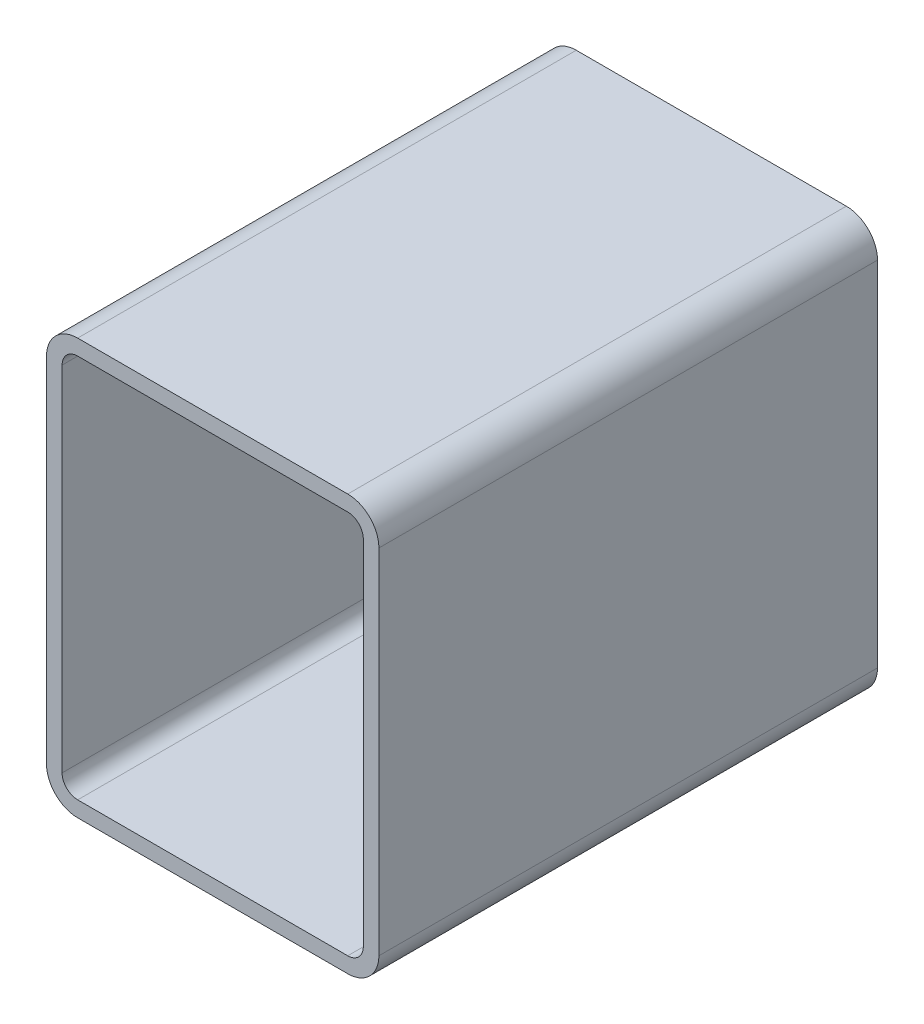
ISO-10303-21;
HEADER;
FILE_DESCRIPTION(('STEP AP214'),'2;1');
FILE_NAME('part.step','',(''),(''),'','','');
FILE_SCHEMA(('AUTOMOTIVE_DESIGN { 1 0 10303 214 1 1 1 1 }'));
ENDSEC;
DATA;
#1=APPLICATION_CONTEXT('core data for automotive mechanical design processes');
#2=APPLICATION_PROTOCOL_DEFINITION('international standard','automotive_design',2000,#1);
#3=PRODUCT_CONTEXT('',#1,'mechanical');
#4=PRODUCT('Part','Part','',(#3));
#5=PRODUCT_RELATED_PRODUCT_CATEGORY('part','',(#4));
#6=PRODUCT_DEFINITION_FORMATION('','',#4);
#7=PRODUCT_DEFINITION_CONTEXT('part definition',#1,'design');
#8=PRODUCT_DEFINITION('design','',#6,#7);
#9=PRODUCT_DEFINITION_SHAPE('','',#8);
#10=(LENGTH_UNIT() NAMED_UNIT(*) SI_UNIT(.MILLI.,.METRE.));
#11=(NAMED_UNIT(*) PLANE_ANGLE_UNIT() SI_UNIT($,.RADIAN.));
#12=(NAMED_UNIT(*) SI_UNIT($,.STERADIAN.) SOLID_ANGLE_UNIT());
#13=UNCERTAINTY_MEASURE_WITH_UNIT(LENGTH_MEASURE(1.E-05),#10,'distance_accuracy_value','');
#14=(GEOMETRIC_REPRESENTATION_CONTEXT(3) GLOBAL_UNCERTAINTY_ASSIGNED_CONTEXT((#13)) GLOBAL_UNIT_ASSIGNED_CONTEXT((#10,
#11,#12)) REPRESENTATION_CONTEXT('',''));
#15=CARTESIAN_POINT('',(0.,0.,0.));
#16=DIRECTION('',(0.,0.,1.));
#17=DIRECTION('',(1.,0.,0.));
#18=AXIS2_PLACEMENT_3D('',#15,#16,#17);
#19=CARTESIAN_POINT('',(185.540940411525,20.9703138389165,304.8));
#20=DIRECTION('',(0.,0.,1.));
#21=DIRECTION('',(1.,0.,0.));
#22=AXIS2_PLACEMENT_3D('',#19,#20,#21);
#23=PLANE('',#22);
#24=CARTESIAN_POINT('',(185.540940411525,20.9703138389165,304.8));
#25=DIRECTION('',(0.,0.,1.));
#26=DIRECTION('',(1.,0.,0.));
#27=AXIS2_PLACEMENT_3D('',#24,#25,#26);
#28=CIRCLE('',#27,19.05);
#29=CARTESIAN_POINT('',(185.540940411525,1.92031383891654,304.8));
#30=VERTEX_POINT('',#29);
#31=CARTESIAN_POINT('',(204.590940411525,20.9703138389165,304.8));
#32=VERTEX_POINT('',#31);
#33=EDGE_CURVE('E211',#30,#32,#28,.T.);
#34=ORIENTED_EDGE('',*,*,#33,.T.);
#35=DIRECTION('',(0.,1.,0.));
#36=VECTOR('',#35,1.);
#37=CARTESIAN_POINT('',(204.590940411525,236.870313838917,304.8));
#38=LINE('',#37,#36);
#39=CARTESIAN_POINT('',(204.590940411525,236.870313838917,304.8));
#40=VERTEX_POINT('',#39);
#41=EDGE_CURVE('E214',#32,#40,#38,.T.);
#42=ORIENTED_EDGE('',*,*,#41,.T.);
#43=CARTESIAN_POINT('',(185.540940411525,236.870313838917,304.8));
#44=DIRECTION('',(0.,0.,1.));
#45=DIRECTION('',(1.,0.,0.));
#46=AXIS2_PLACEMENT_3D('',#43,#44,#45);
#47=CIRCLE('',#46,19.05);
#48=CARTESIAN_POINT('',(185.540940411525,255.920313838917,304.8));
#49=VERTEX_POINT('',#48);
#50=EDGE_CURVE('E217',#40,#49,#47,.T.);
#51=ORIENTED_EDGE('',*,*,#50,.T.);
#52=DIRECTION('',(-1.,0.,0.));
#53=VECTOR('',#52,1.);
#54=CARTESIAN_POINT('',(20.4409404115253,255.920313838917,304.8));
#55=LINE('',#54,#53);
#56=CARTESIAN_POINT('',(20.4409404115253,255.920313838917,304.8));
#57=VERTEX_POINT('',#56);
#58=EDGE_CURVE('E219',#49,#57,#55,.T.);
#59=ORIENTED_EDGE('',*,*,#58,.T.);
#60=CARTESIAN_POINT('',(20.4409404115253,236.870313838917,304.8));
#61=DIRECTION('',(0.,0.,1.));
#62=DIRECTION('',(1.,0.,0.));
#63=AXIS2_PLACEMENT_3D('',#60,#61,#62);
#64=CIRCLE('',#63,19.05);
#65=CARTESIAN_POINT('',(1.3909404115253,236.870313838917,304.8));
#66=VERTEX_POINT('',#65);
#67=EDGE_CURVE('E221',#57,#66,#64,.T.);
#68=ORIENTED_EDGE('',*,*,#67,.T.);
#69=DIRECTION('',(0.,-1.,0.));
#70=VECTOR('',#69,1.);
#71=CARTESIAN_POINT('',(1.3909404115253,20.9703138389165,304.8));
#72=LINE('',#71,#70);
#73=CARTESIAN_POINT('',(1.3909404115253,20.9703138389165,304.8));
#74=VERTEX_POINT('',#73);
#75=EDGE_CURVE('E223',#66,#74,#72,.T.);
#76=ORIENTED_EDGE('',*,*,#75,.T.);
#77=CARTESIAN_POINT('',(20.4409404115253,20.9703138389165,304.8));
#78=DIRECTION('',(0.,0.,1.));
#79=DIRECTION('',(1.,0.,0.));
#80=AXIS2_PLACEMENT_3D('',#77,#78,#79);
#81=CIRCLE('',#80,19.05);
#82=CARTESIAN_POINT('',(20.4409404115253,1.92031383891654,304.8));
#83=VERTEX_POINT('',#82);
#84=EDGE_CURVE('E225',#74,#83,#81,.T.);
#85=ORIENTED_EDGE('',*,*,#84,.T.);
#86=DIRECTION('',(1.,0.,0.));
#87=VECTOR('',#86,1.);
#88=CARTESIAN_POINT('',(185.540940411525,1.92031383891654,304.8));
#89=LINE('',#88,#87);
#90=EDGE_CURVE('E227',#83,#30,#89,.T.);
#91=ORIENTED_EDGE('',*,*,#90,.T.);
#92=EDGE_LOOP('',(#34,#42,#51,#59,#68,#76,#85,#91));
#93=FACE_BOUND('',#92,.T.);
#94=DIRECTION('',(0.,-1.,0.));
#95=VECTOR('',#94,1.);
#96=CARTESIAN_POINT('',(10.9159404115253,20.9703138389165,304.8));
#97=LINE('',#96,#95);
#98=CARTESIAN_POINT('',(10.9159404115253,236.870313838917,304.8));
#99=VERTEX_POINT('',#98);
#100=CARTESIAN_POINT('',(10.9159404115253,20.9703138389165,304.8));
#101=VERTEX_POINT('',#100);
#102=EDGE_CURVE('E154',#99,#101,#97,.T.);
#103=ORIENTED_EDGE('',*,*,#102,.F.);
#104=CARTESIAN_POINT('',(20.4409404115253,236.870313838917,304.8));
#105=DIRECTION('',(0.,0.,1.));
#106=DIRECTION('',(1.,0.,0.));
#107=AXIS2_PLACEMENT_3D('',#104,#105,#106);
#108=CIRCLE('',#107,9.52500000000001);
#109=CARTESIAN_POINT('',(20.4409404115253,246.395313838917,304.8));
#110=VERTEX_POINT('',#109);
#111=EDGE_CURVE('E146',#110,#99,#108,.T.);
#112=ORIENTED_EDGE('',*,*,#111,.F.);
#113=DIRECTION('',(-1.,0.,0.));
#114=VECTOR('',#113,1.);
#115=CARTESIAN_POINT('',(20.4409404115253,246.395313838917,304.8));
#116=LINE('',#115,#114);
#117=CARTESIAN_POINT('',(185.540940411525,246.395313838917,304.8));
#118=VERTEX_POINT('',#117);
#119=EDGE_CURVE('E179',#118,#110,#116,.T.);
#120=ORIENTED_EDGE('',*,*,#119,.F.);
#121=CARTESIAN_POINT('',(185.540940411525,236.870313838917,304.8));
#122=DIRECTION('',(0.,0.,1.));
#123=DIRECTION('',(1.,0.,0.));
#124=AXIS2_PLACEMENT_3D('',#121,#122,#123);
#125=CIRCLE('',#124,9.52500000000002);
#126=CARTESIAN_POINT('',(195.065940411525,236.870313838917,304.8));
#127=VERTEX_POINT('',#126);
#128=EDGE_CURVE('E177',#127,#118,#125,.T.);
#129=ORIENTED_EDGE('',*,*,#128,.F.);
#130=DIRECTION('',(0.,1.,0.));
#131=VECTOR('',#130,1.);
#132=CARTESIAN_POINT('',(195.065940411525,236.870313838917,304.8));
#133=LINE('',#132,#131);
#134=CARTESIAN_POINT('',(195.065940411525,20.9703138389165,304.8));
#135=VERTEX_POINT('',#134);
#136=EDGE_CURVE('E175',#135,#127,#133,.T.);
#137=ORIENTED_EDGE('',*,*,#136,.F.);
#138=CARTESIAN_POINT('',(185.540940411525,20.9703138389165,304.8));
#139=DIRECTION('',(0.,0.,1.));
#140=DIRECTION('',(1.,0.,0.));
#141=AXIS2_PLACEMENT_3D('',#138,#139,#140);
#142=CIRCLE('',#141,9.52500000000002);
#143=CARTESIAN_POINT('',(185.540940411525,11.4453138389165,304.8));
#144=VERTEX_POINT('',#143);
#145=EDGE_CURVE('E173',#144,#135,#142,.T.);
#146=ORIENTED_EDGE('',*,*,#145,.F.);
#147=DIRECTION('',(1.,0.,0.));
#148=VECTOR('',#147,1.);
#149=CARTESIAN_POINT('',(185.540940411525,11.4453138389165,304.8));
#150=LINE('',#149,#148);
#151=CARTESIAN_POINT('',(20.4409404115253,11.4453138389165,304.8));
#152=VERTEX_POINT('',#151);
#153=EDGE_CURVE('E169',#152,#144,#150,.T.);
#154=ORIENTED_EDGE('',*,*,#153,.F.);
#155=CARTESIAN_POINT('',(20.4409404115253,20.9703138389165,304.8));
#156=DIRECTION('',(0.,0.,1.));
#157=DIRECTION('',(1.,0.,0.));
#158=AXIS2_PLACEMENT_3D('',#155,#156,#157);
#159=CIRCLE('',#158,9.525);
#160=EDGE_CURVE('E167',#101,#152,#159,.T.);
#161=ORIENTED_EDGE('',*,*,#160,.F.);
#162=EDGE_LOOP('',(#103,#112,#120,#129,#137,#146,#154,#161));
#163=FACE_BOUND('',#162,.T.);
#164=ADVANCED_FACE('F33',(#93,#163),#23,.T.);
#165=CARTESIAN_POINT('',(185.540940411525,20.9703138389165,0.));
#166=DIRECTION('',(0.,0.,1.));
#167=DIRECTION('',(1.,0.,0.));
#168=AXIS2_PLACEMENT_3D('',#165,#166,#167);
#169=PLANE('',#168);
#170=CARTESIAN_POINT('',(185.540940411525,20.9703138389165,0.));
#171=DIRECTION('',(0.,0.,1.));
#172=DIRECTION('',(1.,0.,0.));
#173=AXIS2_PLACEMENT_3D('',#170,#171,#172);
#174=CIRCLE('',#173,19.05);
#175=CARTESIAN_POINT('',(185.540940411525,1.92031383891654,0.));
#176=VERTEX_POINT('',#175);
#177=CARTESIAN_POINT('',(204.590940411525,20.9703138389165,0.));
#178=VERTEX_POINT('',#177);
#179=EDGE_CURVE('E162',#176,#178,#174,.T.);
#180=ORIENTED_EDGE('',*,*,#179,.F.);
#181=DIRECTION('',(1.,0.,0.));
#182=VECTOR('',#181,1.);
#183=CARTESIAN_POINT('',(185.540940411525,1.92031383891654,0.));
#184=LINE('',#183,#182);
#185=CARTESIAN_POINT('',(20.4409404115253,1.92031383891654,0.));
#186=VERTEX_POINT('',#185);
#187=EDGE_CURVE('E215',#186,#176,#184,.T.);
#188=ORIENTED_EDGE('',*,*,#187,.F.);
#189=CARTESIAN_POINT('',(20.4409404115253,20.9703138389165,0.));
#190=DIRECTION('',(0.,0.,1.));
#191=DIRECTION('',(1.,0.,0.));
#192=AXIS2_PLACEMENT_3D('',#189,#190,#191);
#193=CIRCLE('',#192,19.05);
#194=CARTESIAN_POINT('',(1.3909404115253,20.9703138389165,0.));
#195=VERTEX_POINT('',#194);
#196=EDGE_CURVE('E242',#195,#186,#193,.T.);
#197=ORIENTED_EDGE('',*,*,#196,.F.);
#198=DIRECTION('',(0.,-1.,0.));
#199=VECTOR('',#198,1.);
#200=CARTESIAN_POINT('',(1.3909404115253,20.9703138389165,0.));
#201=LINE('',#200,#199);
#202=CARTESIAN_POINT('',(1.3909404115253,236.870313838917,0.));
#203=VERTEX_POINT('',#202);
#204=EDGE_CURVE('E240',#203,#195,#201,.T.);
#205=ORIENTED_EDGE('',*,*,#204,.F.);
#206=CARTESIAN_POINT('',(20.4409404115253,236.870313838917,0.));
#207=DIRECTION('',(0.,0.,1.));
#208=DIRECTION('',(1.,0.,0.));
#209=AXIS2_PLACEMENT_3D('',#206,#207,#208);
#210=CIRCLE('',#209,19.05);
#211=CARTESIAN_POINT('',(20.4409404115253,255.920313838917,0.));
#212=VERTEX_POINT('',#211);
#213=EDGE_CURVE('E238',#212,#203,#210,.T.);
#214=ORIENTED_EDGE('',*,*,#213,.F.);
#215=DIRECTION('',(-1.,0.,0.));
#216=VECTOR('',#215,1.);
#217=CARTESIAN_POINT('',(20.4409404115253,255.920313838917,0.));
#218=LINE('',#217,#216);
#219=CARTESIAN_POINT('',(185.540940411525,255.920313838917,0.));
#220=VERTEX_POINT('',#219);
#221=EDGE_CURVE('E236',#220,#212,#218,.T.);
#222=ORIENTED_EDGE('',*,*,#221,.F.);
#223=CARTESIAN_POINT('',(185.540940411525,236.870313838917,0.));
#224=DIRECTION('',(0.,0.,1.));
#225=DIRECTION('',(1.,0.,0.));
#226=AXIS2_PLACEMENT_3D('',#223,#224,#225);
#227=CIRCLE('',#226,19.05);
#228=CARTESIAN_POINT('',(204.590940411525,236.870313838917,0.));
#229=VERTEX_POINT('',#228);
#230=EDGE_CURVE('E234',#229,#220,#227,.T.);
#231=ORIENTED_EDGE('',*,*,#230,.F.);
#232=DIRECTION('',(0.,1.,0.));
#233=VECTOR('',#232,1.);
#234=CARTESIAN_POINT('',(204.590940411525,236.870313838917,0.));
#235=LINE('',#234,#233);
#236=EDGE_CURVE('E232',#178,#229,#235,.T.);
#237=ORIENTED_EDGE('',*,*,#236,.F.);
#238=EDGE_LOOP('',(#180,#188,#197,#205,#214,#222,#231,#237));
#239=FACE_BOUND('',#238,.T.);
#240=CARTESIAN_POINT('',(20.4409404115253,236.870313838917,0.));
#241=DIRECTION('',(0.,0.,1.));
#242=DIRECTION('',(1.,0.,0.));
#243=AXIS2_PLACEMENT_3D('',#240,#241,#242);
#244=CIRCLE('',#243,9.52500000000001);
#245=CARTESIAN_POINT('',(20.4409404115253,246.395313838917,0.));
#246=VERTEX_POINT('',#245);
#247=CARTESIAN_POINT('',(10.9159404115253,236.870313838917,0.));
#248=VERTEX_POINT('',#247);
#249=EDGE_CURVE('E56',#246,#248,#244,.T.);
#250=ORIENTED_EDGE('',*,*,#249,.T.);
#251=DIRECTION('',(0.,-1.,0.));
#252=VECTOR('',#251,1.);
#253=CARTESIAN_POINT('',(10.9159404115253,20.9703138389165,0.));
#254=LINE('',#253,#252);
#255=CARTESIAN_POINT('',(10.9159404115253,20.9703138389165,0.));
#256=VERTEX_POINT('',#255);
#257=EDGE_CURVE('E161',#248,#256,#254,.T.);
#258=ORIENTED_EDGE('',*,*,#257,.T.);
#259=CARTESIAN_POINT('',(20.4409404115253,20.9703138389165,0.));
#260=DIRECTION('',(0.,0.,1.));
#261=DIRECTION('',(1.,0.,0.));
#262=AXIS2_PLACEMENT_3D('',#259,#260,#261);
#263=CIRCLE('',#262,9.525);
#264=CARTESIAN_POINT('',(20.4409404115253,11.4453138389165,0.));
#265=VERTEX_POINT('',#264);
#266=EDGE_CURVE('E183',#256,#265,#263,.T.);
#267=ORIENTED_EDGE('',*,*,#266,.T.);
#268=DIRECTION('',(1.,0.,0.));
#269=VECTOR('',#268,1.);
#270=CARTESIAN_POINT('',(185.540940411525,11.4453138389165,0.));
#271=LINE('',#270,#269);
#272=CARTESIAN_POINT('',(185.540940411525,11.4453138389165,0.));
#273=VERTEX_POINT('',#272);
#274=EDGE_CURVE('E186',#265,#273,#271,.T.);
#275=ORIENTED_EDGE('',*,*,#274,.T.);
#276=CARTESIAN_POINT('',(185.540940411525,20.9703138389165,0.));
#277=DIRECTION('',(0.,0.,1.));
#278=DIRECTION('',(1.,0.,0.));
#279=AXIS2_PLACEMENT_3D('',#276,#277,#278);
#280=CIRCLE('',#279,9.52500000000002);
#281=CARTESIAN_POINT('',(195.065940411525,20.9703138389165,0.));
#282=VERTEX_POINT('',#281);
#283=EDGE_CURVE('E189',#273,#282,#280,.T.);
#284=ORIENTED_EDGE('',*,*,#283,.T.);
#285=DIRECTION('',(0.,1.,0.));
#286=VECTOR('',#285,1.);
#287=CARTESIAN_POINT('',(195.065940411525,236.870313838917,0.));
#288=LINE('',#287,#286);
#289=CARTESIAN_POINT('',(195.065940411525,236.870313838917,0.));
#290=VERTEX_POINT('',#289);
#291=EDGE_CURVE('E192',#282,#290,#288,.T.);
#292=ORIENTED_EDGE('',*,*,#291,.T.);
#293=CARTESIAN_POINT('',(185.540940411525,236.870313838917,0.));
#294=DIRECTION('',(0.,0.,1.));
#295=DIRECTION('',(1.,0.,0.));
#296=AXIS2_PLACEMENT_3D('',#293,#294,#295);
#297=CIRCLE('',#296,9.52500000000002);
#298=CARTESIAN_POINT('',(185.540940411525,246.395313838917,0.));
#299=VERTEX_POINT('',#298);
#300=EDGE_CURVE('E195',#290,#299,#297,.T.);
#301=ORIENTED_EDGE('',*,*,#300,.T.);
#302=DIRECTION('',(-1.,0.,0.));
#303=VECTOR('',#302,1.);
#304=CARTESIAN_POINT('',(20.4409404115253,246.395313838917,0.));
#305=LINE('',#304,#303);
#306=EDGE_CURVE('E155',#299,#246,#305,.T.);
#307=ORIENTED_EDGE('',*,*,#306,.T.);
#308=EDGE_LOOP('',(#250,#258,#267,#275,#284,#292,#301,#307));
#309=FACE_BOUND('',#308,.T.);
#310=ADVANCED_FACE('F272',(#239,#309),#169,.F.);
#311=CARTESIAN_POINT('',(185.540940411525,20.9703138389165,304.8));
#312=DIRECTION('',(0.,0.,-1.));
#313=DIRECTION('',(-1.,0.,0.));
#314=AXIS2_PLACEMENT_3D('',#311,#312,#313);
#315=CYLINDRICAL_SURFACE('',#314,19.05);
#316=ORIENTED_EDGE('',*,*,#179,.T.);
#317=DIRECTION('',(0.,0.,-1.));
#318=VECTOR('',#317,1.);
#319=CARTESIAN_POINT('',(204.590940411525,20.9703138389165,304.8));
#320=LINE('',#319,#318);
#321=EDGE_CURVE('E11',#32,#178,#320,.T.);
#322=ORIENTED_EDGE('',*,*,#321,.F.);
#323=ORIENTED_EDGE('',*,*,#33,.F.);
#324=DIRECTION('',(0.,0.,-1.));
#325=VECTOR('',#324,1.);
#326=CARTESIAN_POINT('',(185.540940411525,1.92031383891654,304.8));
#327=LINE('',#326,#325);
#328=EDGE_CURVE('E229',#30,#176,#327,.T.);
#329=ORIENTED_EDGE('',*,*,#328,.T.);
#330=EDGE_LOOP('',(#316,#322,#323,#329));
#331=FACE_BOUND('',#330,.T.);
#332=ADVANCED_FACE('F35',(#331),#315,.T.);
#333=CARTESIAN_POINT('',(204.590940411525,236.870313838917,304.8));
#334=DIRECTION('',(-1.,0.,0.));
#335=DIRECTION('',(0.,0.,1.));
#336=AXIS2_PLACEMENT_3D('',#333,#334,#335);
#337=PLANE('',#336);
#338=ORIENTED_EDGE('',*,*,#236,.T.);
#339=DIRECTION('',(0.,0.,-1.));
#340=VECTOR('',#339,1.);
#341=CARTESIAN_POINT('',(204.590940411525,236.870313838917,304.8));
#342=LINE('',#341,#340);
#343=EDGE_CURVE('E41',#40,#229,#342,.T.);
#344=ORIENTED_EDGE('',*,*,#343,.F.);
#345=ORIENTED_EDGE('',*,*,#41,.F.);
#346=ORIENTED_EDGE('',*,*,#321,.T.);
#347=EDGE_LOOP('',(#338,#344,#345,#346));
#348=FACE_BOUND('',#347,.T.);
#349=ADVANCED_FACE('F289',(#348),#337,.F.);
#350=CARTESIAN_POINT('',(185.540940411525,236.870313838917,304.8));
#351=DIRECTION('',(0.,0.,-1.));
#352=DIRECTION('',(-1.,0.,0.));
#353=AXIS2_PLACEMENT_3D('',#350,#351,#352);
#354=CYLINDRICAL_SURFACE('',#353,19.05);
#355=ORIENTED_EDGE('',*,*,#230,.T.);
#356=DIRECTION('',(0.,0.,-1.));
#357=VECTOR('',#356,1.);
#358=CARTESIAN_POINT('',(185.540940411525,255.920313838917,304.8));
#359=LINE('',#358,#357);
#360=EDGE_CURVE('E259',#49,#220,#359,.T.);
#361=ORIENTED_EDGE('',*,*,#360,.F.);
#362=ORIENTED_EDGE('',*,*,#50,.F.);
#363=ORIENTED_EDGE('',*,*,#343,.T.);
#364=EDGE_LOOP('',(#355,#361,#362,#363));
#365=FACE_BOUND('',#364,.T.);
#366=ADVANCED_FACE('F266',(#365),#354,.T.);
#367=CARTESIAN_POINT('',(20.4409404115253,255.920313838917,304.8));
#368=DIRECTION('',(0.,-1.,0.));
#369=DIRECTION('',(0.,0.,-1.));
#370=AXIS2_PLACEMENT_3D('',#367,#368,#369);
#371=PLANE('',#370);
#372=ORIENTED_EDGE('',*,*,#221,.T.);
#373=DIRECTION('',(0.,0.,-1.));
#374=VECTOR('',#373,1.);
#375=CARTESIAN_POINT('',(20.4409404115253,255.920313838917,304.8));
#376=LINE('',#375,#374);
#377=EDGE_CURVE('E256',#57,#212,#376,.T.);
#378=ORIENTED_EDGE('',*,*,#377,.F.);
#379=ORIENTED_EDGE('',*,*,#58,.F.);
#380=ORIENTED_EDGE('',*,*,#360,.T.);
#381=EDGE_LOOP('',(#372,#378,#379,#380));
#382=FACE_BOUND('',#381,.T.);
#383=ADVANCED_FACE('F278',(#382),#371,.F.);
#384=CARTESIAN_POINT('',(20.4409404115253,236.870313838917,304.8));
#385=DIRECTION('',(0.,0.,-1.));
#386=DIRECTION('',(-1.,0.,0.));
#387=AXIS2_PLACEMENT_3D('',#384,#385,#386);
#388=CYLINDRICAL_SURFACE('',#387,19.05);
#389=ORIENTED_EDGE('',*,*,#213,.T.);
#390=DIRECTION('',(0.,0.,-1.));
#391=VECTOR('',#390,1.);
#392=CARTESIAN_POINT('',(1.3909404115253,236.870313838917,304.8));
#393=LINE('',#392,#391);
#394=EDGE_CURVE('E253',#66,#203,#393,.T.);
#395=ORIENTED_EDGE('',*,*,#394,.F.);
#396=ORIENTED_EDGE('',*,*,#67,.F.);
#397=ORIENTED_EDGE('',*,*,#377,.T.);
#398=EDGE_LOOP('',(#389,#395,#396,#397));
#399=FACE_BOUND('',#398,.T.);
#400=ADVANCED_FACE('F282',(#399),#388,.T.);
#401=CARTESIAN_POINT('',(1.3909404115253,20.9703138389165,304.8));
#402=DIRECTION('',(1.,0.,0.));
#403=DIRECTION('',(0.,0.,-1.));
#404=AXIS2_PLACEMENT_3D('',#401,#402,#403);
#405=PLANE('',#404);
#406=ORIENTED_EDGE('',*,*,#204,.T.);
#407=DIRECTION('',(0.,0.,-1.));
#408=VECTOR('',#407,1.);
#409=CARTESIAN_POINT('',(1.3909404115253,20.9703138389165,304.8));
#410=LINE('',#409,#408);
#411=EDGE_CURVE('E250',#74,#195,#410,.T.);
#412=ORIENTED_EDGE('',*,*,#411,.F.);
#413=ORIENTED_EDGE('',*,*,#75,.F.);
#414=ORIENTED_EDGE('',*,*,#394,.T.);
#415=EDGE_LOOP('',(#406,#412,#413,#414));
#416=FACE_BOUND('',#415,.T.);
#417=ADVANCED_FACE('F302',(#416),#405,.F.);
#418=CARTESIAN_POINT('',(20.4409404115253,20.9703138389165,304.8));
#419=DIRECTION('',(0.,0.,-1.));
#420=DIRECTION('',(-1.,0.,0.));
#421=AXIS2_PLACEMENT_3D('',#418,#419,#420);
#422=CYLINDRICAL_SURFACE('',#421,19.05);
#423=ORIENTED_EDGE('',*,*,#196,.T.);
#424=DIRECTION('',(0.,0.,-1.));
#425=VECTOR('',#424,1.);
#426=CARTESIAN_POINT('',(20.4409404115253,1.92031383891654,304.8));
#427=LINE('',#426,#425);
#428=EDGE_CURVE('E247',#83,#186,#427,.T.);
#429=ORIENTED_EDGE('',*,*,#428,.F.);
#430=ORIENTED_EDGE('',*,*,#84,.F.);
#431=ORIENTED_EDGE('',*,*,#411,.T.);
#432=EDGE_LOOP('',(#423,#429,#430,#431));
#433=FACE_BOUND('',#432,.T.);
#434=ADVANCED_FACE('F300',(#433),#422,.T.);
#435=CARTESIAN_POINT('',(185.540940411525,1.92031383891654,304.8));
#436=DIRECTION('',(0.,1.,0.));
#437=DIRECTION('',(0.,0.,1.));
#438=AXIS2_PLACEMENT_3D('',#435,#436,#437);
#439=PLANE('',#438);
#440=ORIENTED_EDGE('',*,*,#187,.T.);
#441=ORIENTED_EDGE('',*,*,#328,.F.);
#442=ORIENTED_EDGE('',*,*,#90,.F.);
#443=ORIENTED_EDGE('',*,*,#428,.T.);
#444=EDGE_LOOP('',(#440,#441,#442,#443));
#445=FACE_BOUND('',#444,.T.);
#446=ADVANCED_FACE('F295',(#445),#439,.F.);
#447=CARTESIAN_POINT('',(20.4409404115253,236.870313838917,304.8));
#448=DIRECTION('',(0.,0.,-1.));
#449=DIRECTION('',(-1.,0.,0.));
#450=AXIS2_PLACEMENT_3D('',#447,#448,#449);
#451=CYLINDRICAL_SURFACE('',#450,9.52500000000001);
#452=ORIENTED_EDGE('',*,*,#249,.F.);
#453=DIRECTION('',(0.,0.,-1.));
#454=VECTOR('',#453,1.);
#455=CARTESIAN_POINT('',(20.4409404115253,246.395313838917,304.8));
#456=LINE('',#455,#454);
#457=EDGE_CURVE('E150',#110,#246,#456,.T.);
#458=ORIENTED_EDGE('',*,*,#457,.F.);
#459=ORIENTED_EDGE('',*,*,#111,.T.);
#460=DIRECTION('',(0.,0.,-1.));
#461=VECTOR('',#460,1.);
#462=CARTESIAN_POINT('',(10.9159404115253,236.870313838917,304.8));
#463=LINE('',#462,#461);
#464=EDGE_CURVE('E149',#99,#248,#463,.T.);
#465=ORIENTED_EDGE('',*,*,#464,.T.);
#466=EDGE_LOOP('',(#452,#458,#459,#465));
#467=FACE_BOUND('',#466,.T.);
#468=ADVANCED_FACE('F148',(#467),#451,.F.);
#469=CARTESIAN_POINT('',(10.9159404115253,20.9703138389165,304.8));
#470=DIRECTION('',(1.,0.,0.));
#471=DIRECTION('',(0.,0.,-1.));
#472=AXIS2_PLACEMENT_3D('',#469,#470,#471);
#473=PLANE('',#472);
#474=ORIENTED_EDGE('',*,*,#257,.F.);
#475=ORIENTED_EDGE('',*,*,#464,.F.);
#476=ORIENTED_EDGE('',*,*,#102,.T.);
#477=DIRECTION('',(0.,0.,-1.));
#478=VECTOR('',#477,1.);
#479=CARTESIAN_POINT('',(10.9159404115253,20.9703138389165,304.8));
#480=LINE('',#479,#478);
#481=EDGE_CURVE('E163',#101,#256,#480,.T.);
#482=ORIENTED_EDGE('',*,*,#481,.T.);
#483=EDGE_LOOP('',(#474,#475,#476,#482));
#484=FACE_BOUND('',#483,.T.);
#485=ADVANCED_FACE('F158',(#484),#473,.T.);
#486=CARTESIAN_POINT('',(20.4409404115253,20.9703138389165,304.8));
#487=DIRECTION('',(0.,0.,-1.));
#488=DIRECTION('',(-1.,0.,0.));
#489=AXIS2_PLACEMENT_3D('',#486,#487,#488);
#490=CYLINDRICAL_SURFACE('',#489,9.525);
#491=ORIENTED_EDGE('',*,*,#266,.F.);
#492=ORIENTED_EDGE('',*,*,#481,.F.);
#493=ORIENTED_EDGE('',*,*,#160,.T.);
#494=DIRECTION('',(0.,0.,-1.));
#495=VECTOR('',#494,1.);
#496=CARTESIAN_POINT('',(20.4409404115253,11.4453138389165,304.8));
#497=LINE('',#496,#495);
#498=EDGE_CURVE('E208',#152,#265,#497,.T.);
#499=ORIENTED_EDGE('',*,*,#498,.T.);
#500=EDGE_LOOP('',(#491,#492,#493,#499));
#501=FACE_BOUND('',#500,.T.);
#502=ADVANCED_FACE('F327',(#501),#490,.F.);
#503=CARTESIAN_POINT('',(185.540940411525,11.4453138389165,304.8));
#504=DIRECTION('',(0.,1.,0.));
#505=DIRECTION('',(0.,0.,1.));
#506=AXIS2_PLACEMENT_3D('',#503,#504,#505);
#507=PLANE('',#506);
#508=ORIENTED_EDGE('',*,*,#274,.F.);
#509=ORIENTED_EDGE('',*,*,#498,.F.);
#510=ORIENTED_EDGE('',*,*,#153,.T.);
#511=DIRECTION('',(0.,0.,-1.));
#512=VECTOR('',#511,1.);
#513=CARTESIAN_POINT('',(185.540940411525,11.4453138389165,304.8));
#514=LINE('',#513,#512);
#515=EDGE_CURVE('E206',#144,#273,#514,.T.);
#516=ORIENTED_EDGE('',*,*,#515,.T.);
#517=EDGE_LOOP('',(#508,#509,#510,#516));
#518=FACE_BOUND('',#517,.T.);
#519=ADVANCED_FACE('F331',(#518),#507,.T.);
#520=CARTESIAN_POINT('',(185.540940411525,20.9703138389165,304.8));
#521=DIRECTION('',(0.,0.,-1.));
#522=DIRECTION('',(-1.,0.,0.));
#523=AXIS2_PLACEMENT_3D('',#520,#521,#522);
#524=CYLINDRICAL_SURFACE('',#523,9.52500000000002);
#525=ORIENTED_EDGE('',*,*,#283,.F.);
#526=ORIENTED_EDGE('',*,*,#515,.F.);
#527=ORIENTED_EDGE('',*,*,#145,.T.);
#528=DIRECTION('',(0.,0.,-1.));
#529=VECTOR('',#528,1.);
#530=CARTESIAN_POINT('',(195.065940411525,20.9703138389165,304.8));
#531=LINE('',#530,#529);
#532=EDGE_CURVE('E204',#135,#282,#531,.T.);
#533=ORIENTED_EDGE('',*,*,#532,.T.);
#534=EDGE_LOOP('',(#525,#526,#527,#533));
#535=FACE_BOUND('',#534,.T.);
#536=ADVANCED_FACE('F337',(#535),#524,.F.);
#537=CARTESIAN_POINT('',(195.065940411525,236.870313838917,304.8));
#538=DIRECTION('',(-1.,0.,0.));
#539=DIRECTION('',(0.,0.,1.));
#540=AXIS2_PLACEMENT_3D('',#537,#538,#539);
#541=PLANE('',#540);
#542=ORIENTED_EDGE('',*,*,#291,.F.);
#543=ORIENTED_EDGE('',*,*,#532,.F.);
#544=ORIENTED_EDGE('',*,*,#136,.T.);
#545=DIRECTION('',(0.,0.,-1.));
#546=VECTOR('',#545,1.);
#547=CARTESIAN_POINT('',(195.065940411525,236.870313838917,304.8));
#548=LINE('',#547,#546);
#549=EDGE_CURVE('E202',#127,#290,#548,.T.);
#550=ORIENTED_EDGE('',*,*,#549,.T.);
#551=EDGE_LOOP('',(#542,#543,#544,#550));
#552=FACE_BOUND('',#551,.T.);
#553=ADVANCED_FACE('F341',(#552),#541,.T.);
#554=CARTESIAN_POINT('',(185.540940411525,236.870313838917,304.8));
#555=DIRECTION('',(0.,0.,-1.));
#556=DIRECTION('',(-1.,0.,0.));
#557=AXIS2_PLACEMENT_3D('',#554,#555,#556);
#558=CYLINDRICAL_SURFACE('',#557,9.52500000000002);
#559=ORIENTED_EDGE('',*,*,#300,.F.);
#560=ORIENTED_EDGE('',*,*,#549,.F.);
#561=ORIENTED_EDGE('',*,*,#128,.T.);
#562=DIRECTION('',(0.,0.,-1.));
#563=VECTOR('',#562,1.);
#564=CARTESIAN_POINT('',(185.540940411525,246.395313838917,304.8));
#565=LINE('',#564,#563);
#566=EDGE_CURVE('E48',#118,#299,#565,.T.);
#567=ORIENTED_EDGE('',*,*,#566,.T.);
#568=EDGE_LOOP('',(#559,#560,#561,#567));
#569=FACE_BOUND('',#568,.T.);
#570=ADVANCED_FACE('F345',(#569),#558,.F.);
#571=CARTESIAN_POINT('',(20.4409404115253,246.395313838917,304.8));
#572=DIRECTION('',(0.,-1.,0.));
#573=DIRECTION('',(0.,0.,-1.));
#574=AXIS2_PLACEMENT_3D('',#571,#572,#573);
#575=PLANE('',#574);
#576=ORIENTED_EDGE('',*,*,#306,.F.);
#577=ORIENTED_EDGE('',*,*,#566,.F.);
#578=ORIENTED_EDGE('',*,*,#119,.T.);
#579=ORIENTED_EDGE('',*,*,#457,.T.);
#580=EDGE_LOOP('',(#576,#577,#578,#579));
#581=FACE_BOUND('',#580,.T.);
#582=ADVANCED_FACE('F349',(#581),#575,.T.);
#583=CLOSED_SHELL('',(#164,#310,#332,#349,#366,#383,#400,#417,#434,#446,#468,#485,#502,#519,
#536,#553,#570,#582));
#584=MANIFOLD_SOLID_BREP('B2',#583);
#585=ADVANCED_BREP_SHAPE_REPRESENTATION('',(#18,#584),#14);
#586=SHAPE_DEFINITION_REPRESENTATION(#9,#585);
ENDSEC;
END-ISO-10303-21;
